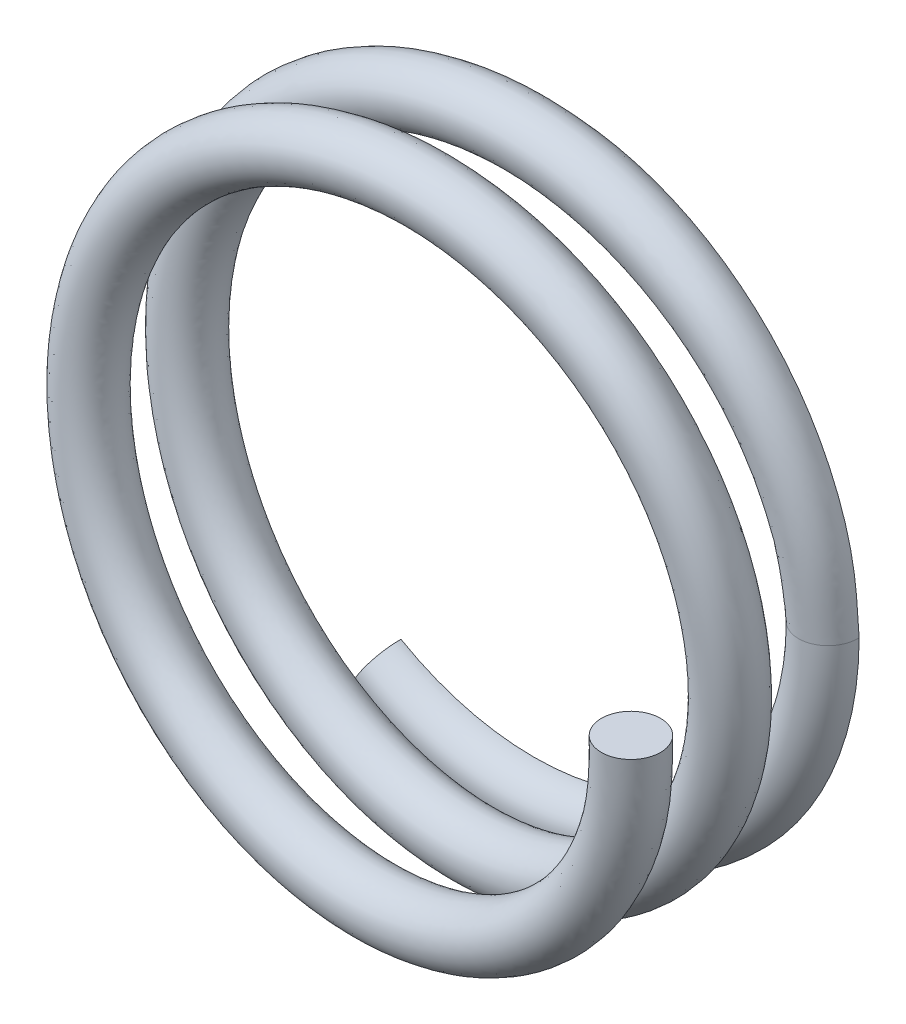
ISO-10303-21;
HEADER;
FILE_DESCRIPTION(('STEP AP214'),'2;1');
FILE_NAME('part.step','',(''),(''),'','','');
FILE_SCHEMA(('AUTOMOTIVE_DESIGN { 1 0 10303 214 1 1 1 1 }'));
ENDSEC;
DATA;
#1=APPLICATION_CONTEXT('core data for automotive mechanical design processes');
#2=APPLICATION_PROTOCOL_DEFINITION('international standard','automotive_design',2000,#1);
#3=PRODUCT_CONTEXT('',#1,'mechanical');
#4=PRODUCT('Part','Part','',(#3));
#5=PRODUCT_RELATED_PRODUCT_CATEGORY('part','',(#4));
#6=PRODUCT_DEFINITION_FORMATION('','',#4);
#7=PRODUCT_DEFINITION_CONTEXT('part definition',#1,'design');
#8=PRODUCT_DEFINITION('design','',#6,#7);
#9=PRODUCT_DEFINITION_SHAPE('','',#8);
#10=(LENGTH_UNIT() NAMED_UNIT(*) SI_UNIT(.MILLI.,.METRE.));
#11=(NAMED_UNIT(*) PLANE_ANGLE_UNIT() SI_UNIT($,.RADIAN.));
#12=(NAMED_UNIT(*) SI_UNIT($,.STERADIAN.) SOLID_ANGLE_UNIT());
#13=UNCERTAINTY_MEASURE_WITH_UNIT(LENGTH_MEASURE(1.E-05),#10,'distance_accuracy_value','');
#14=(GEOMETRIC_REPRESENTATION_CONTEXT(3) GLOBAL_UNCERTAINTY_ASSIGNED_CONTEXT((#13)) GLOBAL_UNIT_ASSIGNED_CONTEXT((#10,
#11,#12)) REPRESENTATION_CONTEXT('',''));
#15=CARTESIAN_POINT('',(0.,0.,0.));
#16=DIRECTION('',(0.,0.,1.));
#17=DIRECTION('',(1.,0.,0.));
#18=AXIS2_PLACEMENT_3D('',#15,#16,#17);
#19=CARTESIAN_POINT('',(15.,0.,1.5));
#20=CARTESIAN_POINT('',(14.9434686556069,0.980039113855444,1.55199637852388));
#21=CARTESIAN_POINT('',(14.8302225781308,2.94329660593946,1.65615781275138));
#22=CARTESIAN_POINT('',(13.9418455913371,5.77650274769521,1.81245356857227));
#23=CARTESIAN_POINT('',(12.5535226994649,8.38759891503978,1.96879275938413));
#24=CARTESIAN_POINT('',(10.4671696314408,10.9271623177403,2.14223062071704));
#25=CARTESIAN_POINT('',(7.58613571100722,13.1398555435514,2.33334011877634));
#26=CARTESIAN_POINT('',(3.92662071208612,14.6543917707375,2.54166504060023));
#27=CARTESIAN_POINT('',(4.11401899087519E-05,15.1715918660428,2.75000784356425));
#28=CARTESIAN_POINT('',(-3.92693257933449,14.6556022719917,2.95833111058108));
#29=CARTESIAN_POINT('',(-7.58586251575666,13.1389788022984,3.1666585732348));
#30=CARTESIAN_POINT('',(-10.7277085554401,10.7277374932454,3.37500627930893));
#31=CARTESIAN_POINT('',(-13.1395863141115,7.58619905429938,3.58333901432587));
#32=CARTESIAN_POINT('',(-14.6551693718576,3.92680798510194,3.79165669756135));
#33=CARTESIAN_POINT('',(-15.1712462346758,-3.12971002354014E-05,3.99999979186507));
#34=CARTESIAN_POINT('',(-14.6548300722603,-3.92669076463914,4.20834340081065));
#35=CARTESIAN_POINT('',(-13.1398206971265,-7.58627068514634,4.41666146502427));
#36=CARTESIAN_POINT('',(-10.7278130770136,-10.7278977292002,4.62499295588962));
#37=CARTESIAN_POINT('',(-7.58571450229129,-13.1387744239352,4.83334182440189));
#38=CARTESIAN_POINT('',(-3.92696085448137,-14.6554610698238,5.04166963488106));
#39=CARTESIAN_POINT('',(4.36291658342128E-05,-15.1719571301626,5.24998976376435));
#40=CARTESIAN_POINT('',(3.92661725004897,-14.6542791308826,5.45833563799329));
#41=CARTESIAN_POINT('',(7.5859316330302,-13.1393329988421,5.66667583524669));
#42=CARTESIAN_POINT('',(10.7285480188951,-10.7285399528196,5.87499262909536));
#43=CARTESIAN_POINT('',(13.1388208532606,-7.58563797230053,6.08332834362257));
#44=CARTESIAN_POINT('',(14.6545092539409,-3.92671133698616,6.29167635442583));
#45=CARTESIAN_POINT('',(15.1725636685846,-3.08605043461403E-05,6.50000018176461));
#46=CARTESIAN_POINT('',(14.6547973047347,3.92679649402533,6.70832353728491));
#47=CARTESIAN_POINT('',(13.1386860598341,7.58562008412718,6.91667133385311));
#48=CARTESIAN_POINT('',(10.7283643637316,10.7282883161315,7.12500762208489));
#49=CARTESIAN_POINT('',(7.58613817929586,13.1396144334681,7.33332434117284));
#50=CARTESIAN_POINT('',(3.92657585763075,14.6543562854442,7.54166400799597));
#51=CARTESIAN_POINT('',(5.35997314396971E-05,15.1716155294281,7.75001022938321));
#52=CARTESIAN_POINT('',(-3.92693805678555,14.6556080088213,7.95833071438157));
#53=CARTESIAN_POINT('',(-7.58585858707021,13.1389737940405,8.16665797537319));
#54=CARTESIAN_POINT('',(-10.7277098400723,10.7277381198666,8.37500677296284));
#55=CARTESIAN_POINT('',(-13.1395867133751,7.58619950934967,8.5833388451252));
#56=CARTESIAN_POINT('',(-14.6551692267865,3.92680794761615,8.79165668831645));
#57=CARTESIAN_POINT('',(-15.1712461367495,-3.14499375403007E-05,8.9999998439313));
#58=CARTESIAN_POINT('',(-14.654829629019,-3.92669054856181,9.20834339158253));
#59=CARTESIAN_POINT('',(-13.1398232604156,-7.58627176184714,9.41666129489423));
#60=CARTESIAN_POINT('',(-10.7278077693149,-10.7278945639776,9.62499345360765));
#61=CARTESIAN_POINT('',(-7.58571958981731,-13.1387763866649,9.83334122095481));
#62=CARTESIAN_POINT('',(-3.92696098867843,-14.655487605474,10.041669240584));
#63=CARTESIAN_POINT('',(2.9082075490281E-05,-15.171864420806,10.2499921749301));
#64=CARTESIAN_POINT('',(3.92668405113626,-14.6543878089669,10.4583345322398));
#65=CARTESIAN_POINT('',(7.58592254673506,-13.1395893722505,10.6666601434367));
#66=CARTESIAN_POINT('',(10.4672636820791,-10.9272676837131,10.8577695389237));
#67=CARTESIAN_POINT('',(12.553480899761,-8.38754549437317,11.0312069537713));
#68=CARTESIAN_POINT('',(13.9422248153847,-5.77671048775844,11.187546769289));
#69=CARTESIAN_POINT('',(14.8299103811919,-2.94320033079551,11.3438418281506));
#70=CARTESIAN_POINT('',(14.9432613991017,-0.980005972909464,11.4480035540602));
#71=CARTESIAN_POINT('',(14.9998450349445,4.25082742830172E-10,11.4999999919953));
#72=CARTESIAN_POINT('',(18.,0.,1.5));
#73=CARTESIAN_POINT('',(17.9323063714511,1.17617130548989,1.55193830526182));
#74=CARTESIAN_POINT('',(17.7966995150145,3.53232943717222,1.6559834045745));
#75=CARTESIAN_POINT('',(16.7304312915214,6.93069596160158,1.81304095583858));
#76=CARTESIAN_POINT('',(15.0648037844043,10.0648097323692,1.96888233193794));
#77=CARTESIAN_POINT('',(12.5582750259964,13.1148525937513,2.14252497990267));
#78=CARTESIAN_POINT('',(9.10608570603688,15.7659272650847,2.33316062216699));
#79=CARTESIAN_POINT('',(4.71216641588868,17.5858635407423,2.54183736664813));
#80=CARTESIAN_POINT('',(-0.00209417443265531,18.2059563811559,2.75042629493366));
#81=CARTESIAN_POINT('',(-4.71136257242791,17.5866699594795,2.958385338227));
#82=CARTESIAN_POINT('',(-9.10182717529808,15.7677965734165,3.16657352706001));
#83=CARTESIAN_POINT('',(-12.8743834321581,12.8727598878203,3.37533635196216));
#84=CARTESIAN_POINT('',(-15.7680538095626,9.10199791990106,3.58373251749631));
#85=CARTESIAN_POINT('',(-17.5855251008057,4.71436549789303,3.7914596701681));
#86=CARTESIAN_POINT('',(-18.2060659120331,-2.21536066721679E-05,4.00015466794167));
#87=CARTESIAN_POINT('',(-17.5851902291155,-4.71423300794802,4.20884973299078));
#88=CARTESIAN_POINT('',(-15.7682950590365,-9.10205608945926,4.41658110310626));
#89=CARTESIAN_POINT('',(-12.8745053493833,-12.8729042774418,4.62496853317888));
#90=CARTESIAN_POINT('',(-9.10167577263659,-15.7675961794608,4.83373398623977));
#91=CARTESIAN_POINT('',(-4.71143842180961,-17.5864986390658,5.04195919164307));
#92=CARTESIAN_POINT('',(-0.0021430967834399,-18.2063741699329,5.24981036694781));
#93=CARTESIAN_POINT('',(4.7124657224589,-17.5855720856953,5.45855207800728));
#94=CARTESIAN_POINT('',(9.1049848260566,-15.7659968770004,5.66717218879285));
#95=CARTESIAN_POINT('',(12.8726878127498,-12.8754697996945,5.8748441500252));
#96=CARTESIAN_POINT('',(15.7665939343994,-9.10371710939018,6.08336225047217));
#97=CARTESIAN_POINT('',(17.5861149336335,-4.71026018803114,6.29212393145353));
#98=CARTESIAN_POINT('',(18.2067610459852,-3.84891972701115E-05,6.50015514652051));
#99=CARTESIAN_POINT('',(17.5864072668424,4.71032890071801,6.70818589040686));
#100=CARTESIAN_POINT('',(15.7664681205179,9.10368379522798,6.91694735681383));
#101=CARTESIAN_POINT('',(12.8725152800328,12.875207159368,7.12546603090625));
#102=CARTESIAN_POINT('',(9.1052051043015,15.7662702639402,7.33313791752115));
#103=CARTESIAN_POINT('',(4.71244168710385,17.5856445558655,7.54175749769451));
#104=CARTESIAN_POINT('',(-0.00211652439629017,18.2060326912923,7.75049955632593));
#105=CARTESIAN_POINT('',(-4.71140083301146,17.5866495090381,7.95835108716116));
#106=CARTESIAN_POINT('',(-9.10180477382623,15.7678041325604,8.16657574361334));
#107=CARTESIAN_POINT('',(-12.8743897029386,12.872757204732,8.37534112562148));
#108=CARTESIAN_POINT('',(-15.7680534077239,9.10199831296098,8.58372913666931));
#109=CARTESIAN_POINT('',(-17.5855250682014,4.71436584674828,8.791460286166));
#110=CARTESIAN_POINT('',(-18.2060658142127,-2.25735037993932E-05,9.00015489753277));
#111=CARTESIAN_POINT('',(-17.5851896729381,-4.71423240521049,9.20885034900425));
#112=CARTESIAN_POINT('',(-15.7682984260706,-9.10205722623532,9.41657772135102));
#113=CARTESIAN_POINT('',(-12.8744950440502,-12.8729044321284,9.62497331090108));
#114=CARTESIAN_POINT('',(-9.10169935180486,-15.7675855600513,9.83373619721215));
#115=CARTESIAN_POINT('',(-4.71140576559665,-17.5865513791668,10.0419249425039));
#116=CARTESIAN_POINT('',(-0.00212275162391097,-18.2062287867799,10.2498836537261));
#117=CARTESIAN_POINT('',(4.71221213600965,-17.5858643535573,10.4584721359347));
#118=CARTESIAN_POINT('',(9.10585910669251,-15.7656689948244,10.6671495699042));
#119=CARTESIAN_POINT('',(12.5583574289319,-13.114968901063,10.8577851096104));
#120=CARTESIAN_POINT('',(15.0647522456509,-10.0647709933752,11.0314273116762));
#121=CARTESIAN_POINT('',(16.7308047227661,-6.9309177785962,11.1872693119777));
#122=CARTESIAN_POINT('',(17.7963837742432,-3.53225069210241,11.3443261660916));
#123=CARTESIAN_POINT('',(17.9320979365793,-1.17615475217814,11.4483715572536));
#124=CARTESIAN_POINT('',(17.99984501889,-1.64418778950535E-05,11.5003099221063));
#125=CARTESIAN_POINT('',(18.,0.,-1.5));
#126=CARTESIAN_POINT('',(17.9322539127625,1.17614724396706,-1.44806169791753));
#127=CARTESIAN_POINT('',(17.7965419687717,3.53225717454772,-1.34401660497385));
#128=CARTESIAN_POINT('',(16.7309520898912,6.93096946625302,-1.18695900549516));
#129=CARTESIAN_POINT('',(15.0648944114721,10.0648383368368,-1.03111766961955));
#130=CARTESIAN_POINT('',(12.5584754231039,13.1150736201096,-0.857475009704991));
#131=CARTESIAN_POINT('',(9.10594614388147,15.7657987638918,-0.666839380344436));
#132=CARTESIAN_POINT('',(4.71227811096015,17.5860086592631,-0.458162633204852));
#133=CARTESIAN_POINT('',(-0.00210690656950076,18.2063865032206,-0.249573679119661));
#134=CARTESIAN_POINT('',(-4.71143793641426,17.5867047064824,-0.0416146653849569));
#135=CARTESIAN_POINT('',(-9.10175901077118,15.7677312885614,0.166573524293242));
#136=CARTESIAN_POINT('',(-12.8745903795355,12.873031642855,0.375336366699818));
#137=CARTESIAN_POINT('',(-15.7684298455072,9.10214392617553,0.583732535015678));
#138=CARTESIAN_POINT('',(-17.5853365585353,4.71428665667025,0.791459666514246));
#139=CARTESIAN_POINT('',(-18.2062225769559,4.75475799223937E-05,1.0001546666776));
#140=CARTESIAN_POINT('',(-17.5856809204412,-4.71439295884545,1.20884976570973));
#141=CARTESIAN_POINT('',(-15.7681935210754,-9.10206822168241,1.41658109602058));
#142=CARTESIAN_POINT('',(-12.874516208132,-12.8728515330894,1.62496852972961));
#143=CARTESIAN_POINT('',(-9.1019016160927,-15.7679300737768,1.83373400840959));
#144=CARTESIAN_POINT('',(-4.71144975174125,-17.5867989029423,2.04195919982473));
#145=CARTESIAN_POINT('',(-0.00213308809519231,-18.206188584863,2.24981036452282));
#146=CARTESIAN_POINT('',(4.71245845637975,-17.5858025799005,2.45855208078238));
#147=CARTESIAN_POINT('',(9.10527327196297,-15.7664127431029,2.66717221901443));
#148=CARTESIAN_POINT('',(12.8726180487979,-12.8753251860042,2.87484414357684));
#149=CARTESIAN_POINT('',(15.7665915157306,-9.10378273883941,3.08336224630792));
#150=CARTESIAN_POINT('',(17.5865546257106,-4.71038774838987,3.29212395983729));
#151=CARTESIAN_POINT('',(18.2069177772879,3.01427640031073E-05,3.50015514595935));
#152=CARTESIAN_POINT('',(17.5862704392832,4.71028228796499,3.70818588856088));
#153=CARTESIAN_POINT('',(15.7667420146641,9.10377499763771,3.9169473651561));
#154=CARTESIAN_POINT('',(12.8728065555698,12.875573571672,4.12546605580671));
#155=CARTESIAN_POINT('',(9.10507359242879,15.7661257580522,4.33313791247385));
#156=CARTESIAN_POINT('',(4.71253014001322,17.585716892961,4.54175749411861));
#157=CARTESIAN_POINT('',(-0.00212675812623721,18.2065317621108,4.75049958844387));
#158=CARTESIAN_POINT('',(-4.71147054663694,17.586652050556,4.9583510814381));
#159=CARTESIAN_POINT('',(-9.10173554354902,15.7677418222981,5.16657574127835));
#160=CARTESIAN_POINT('',(-12.8746006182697,12.8730315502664,5.37534114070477));
#161=CARTESIAN_POINT('',(-15.7684264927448,9.10214277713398,5.58372915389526));
#162=CARTESIAN_POINT('',(-17.5853371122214,4.71428725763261,5.7914602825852));
#163=CARTESIAN_POINT('',(-18.2062226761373,4.71276689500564E-05,6.00015489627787));
#164=CARTESIAN_POINT('',(-17.5856809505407,-4.71439260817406,6.20885038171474));
#165=CARTESIAN_POINT('',(-15.7681939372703,-9.10206781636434,6.41657771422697));
#166=CARTESIAN_POINT('',(-12.8745098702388,-12.8728542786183,6.62497330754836));
#167=CARTESIAN_POINT('',(-9.10192413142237,-15.7679224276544,6.83373621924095));
#168=CARTESIAN_POINT('',(-4.71141144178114,-17.5868194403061,7.04192494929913));
#169=CARTESIAN_POINT('',(-0.00211024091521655,-18.2061121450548,7.249883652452));
#170=CARTESIAN_POINT('',(4.71218159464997,-17.5860220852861,7.45847213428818));
#171=CARTESIAN_POINT('',(9.10615569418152,-15.7660687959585,7.66714960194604));
#172=CARTESIAN_POINT('',(12.5583730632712,-13.1149738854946,7.85778510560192));
#173=CARTESIAN_POINT('',(15.0649210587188,-10.0649156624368,8.0314273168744));
#174=CARTESIAN_POINT('',(16.7305720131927,-6.93076351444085,8.18726930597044));
#175=CARTESIAN_POINT('',(17.7968477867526,-3.53238380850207,8.34432619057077));
#176=CARTESIAN_POINT('',(17.9324591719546,-1.17619907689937,8.44837157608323));
#177=CARTESIAN_POINT('',(18.000154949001,-1.64427272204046E-05,8.50030993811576));
#178=CARTESIAN_POINT('',(15.,0.,-1.5));
#179=CARTESIAN_POINT('',(14.9434161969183,0.980015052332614,-1.44800362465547));
#180=CARTESIAN_POINT('',(14.830065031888,2.94322434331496,-1.34384219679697));
#181=CARTESIAN_POINT('',(13.9423663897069,5.77677625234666,-1.18754639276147));
#182=CARTESIAN_POINT('',(12.5536133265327,8.38762751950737,-1.03120724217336));
#183=CARTESIAN_POINT('',(10.4673700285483,10.9273833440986,-0.857769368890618));
#184=CARTESIAN_POINT('',(7.58599614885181,13.1397270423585,-0.666659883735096));
#185=CARTESIAN_POINT('',(3.92673240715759,14.6545368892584,-0.458334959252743));
#186=CARTESIAN_POINT('',(2.84080530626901E-05,15.1720219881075,-0.249992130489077));
#187=CARTESIAN_POINT('',(-3.92700794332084,14.6556370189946,-0.0416688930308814));
#188=CARTESIAN_POINT('',(-7.58579435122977,13.1389135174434,0.166658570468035));
#189=CARTESIAN_POINT('',(-10.7279155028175,10.7280092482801,0.375006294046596));
#190=CARTESIAN_POINT('',(-13.1399623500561,7.58634506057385,0.58333903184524));
#191=CARTESIAN_POINT('',(-14.6549808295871,3.92672914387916,0.791656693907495));
#192=CARTESIAN_POINT('',(-15.1714028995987,3.8404086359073E-05,0.999999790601));
#193=CARTESIAN_POINT('',(-14.655320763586,-3.92685071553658,1.2083434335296));
#194=CARTESIAN_POINT('',(-13.1397191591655,-7.58628281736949,1.41666145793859));
#195=CARTESIAN_POINT('',(-10.7278239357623,-10.7278449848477,1.62499295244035));
#196=CARTESIAN_POINT('',(-7.58594034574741,-13.1391083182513,1.83334184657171));
#197=CARTESIAN_POINT('',(-3.926972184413,-14.6557613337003,2.04166964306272));
#198=CARTESIAN_POINT('',(5.36378540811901E-05,-15.1717715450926,2.24998976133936));
#199=CARTESIAN_POINT('',(3.92660998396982,-14.6545096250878,2.45833564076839));
#200=CARTESIAN_POINT('',(7.58622007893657,-13.1397488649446,2.66667586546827));
#201=CARTESIAN_POINT('',(10.7284782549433,-10.7283953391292,2.87499262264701));
#202=CARTESIAN_POINT('',(13.1388184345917,-7.58570360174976,3.08332833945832));
#203=CARTESIAN_POINT('',(14.654948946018,-3.9268388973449,3.2916763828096));
#204=CARTESIAN_POINT('',(15.1727203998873,3.77714569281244E-05,3.50000018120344));
#205=CARTESIAN_POINT('',(14.6546604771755,3.92674988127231,3.70832353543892));
#206=CARTESIAN_POINT('',(13.1389599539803,7.58571128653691,3.91667134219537));
#207=CARTESIAN_POINT('',(10.7286556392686,10.7286547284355,4.12500764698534));
#208=CARTESIAN_POINT('',(7.58600666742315,13.13946992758,4.33332433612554));
#209=CARTESIAN_POINT('',(3.92666431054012,14.6544286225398,4.54166400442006));
#210=CARTESIAN_POINT('',(4.33660014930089E-05,15.1721146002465,4.75001026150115));
#211=CARTESIAN_POINT('',(-3.92700777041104,14.6556105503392,4.95833070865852));
#212=CARTESIAN_POINT('',(-7.585789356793,13.1389114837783,5.1666579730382));
#213=CARTESIAN_POINT('',(-10.7279207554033,10.728012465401,5.37500678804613));
#214=CARTESIAN_POINT('',(-13.1399597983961,7.58634397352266,5.58333886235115));
#215=CARTESIAN_POINT('',(-14.6549812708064,3.92672935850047,5.79165668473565));
#216=CARTESIAN_POINT('',(-15.1714029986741,3.82512352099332E-05,5.9999998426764));
#217=CARTESIAN_POINT('',(-14.6553209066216,-3.92685075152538,6.20834342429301));
#218=CARTESIAN_POINT('',(-13.1397187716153,-7.58628235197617,6.41666128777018));
#219=CARTESIAN_POINT('',(-10.7278225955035,-10.7278444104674,6.62499345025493));
#220=CARTESIAN_POINT('',(-7.58594436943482,-13.139113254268,6.83334124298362));
#221=CARTESIAN_POINT('',(-3.92696666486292,-14.6557556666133,7.04166924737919));
#222=CARTESIAN_POINT('',(4.15927841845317E-05,-15.171747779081,7.24999217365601));
#223=CARTESIAN_POINT('',(3.92665350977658,-14.6545455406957,7.45833453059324));
#224=CARTESIAN_POINT('',(7.58621913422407,-13.1399891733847,7.6666601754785));
#225=CARTESIAN_POINT('',(10.4672793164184,-10.9272726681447,7.85776953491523));
#226=CARTESIAN_POINT('',(12.5536497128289,-8.38769016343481,8.03120695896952));
#227=CARTESIAN_POINT('',(13.9419921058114,-5.77655622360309,8.1875467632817));
#228=CARTESIAN_POINT('',(14.8303743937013,-2.94333344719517,8.34384185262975));
#229=CARTESIAN_POINT('',(14.943622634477,-0.980050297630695,8.44800357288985));
#230=CARTESIAN_POINT('',(15.0001549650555,-4.24242608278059E-10,8.50000000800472));
#231=CARTESIAN_POINT('',(12.,0.,-1.5));
#232=CARTESIAN_POINT('',(11.9545784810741,0.783882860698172,-1.44794555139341));
#233=CARTESIAN_POINT('',(11.8635880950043,2.35419151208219,-1.34366778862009));
#234=CARTESIAN_POINT('',(11.1537806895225,4.6225830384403,-1.18813378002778));
#235=CARTESIAN_POINT('',(10.0423322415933,6.71041670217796,-1.03129681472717));
#236=CARTESIAN_POINT('',(8.37626463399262,8.73969306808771,-0.858063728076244));
#237=CARTESIAN_POINT('',(6.06604615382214,10.5136553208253,-0.666480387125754));
#238=CARTESIAN_POINT('',(3.14118670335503,11.7230651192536,-0.458507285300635));
#239=CARTESIAN_POINT('',(0.00216372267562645,12.1376574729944,-0.250410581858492));
#240=CARTESIAN_POINT('',(-3.14257795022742,11.7245693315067,-0.041723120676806));
#241=CARTESIAN_POINT('',(-6.06982969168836,10.5100957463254,0.166743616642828));
#242=CARTESIAN_POINT('',(-8.5812406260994,8.58298685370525,0.374676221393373));
#243=CARTESIAN_POINT('',(-10.5114948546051,6.07054619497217,0.582945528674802));
#244=CARTESIAN_POINT('',(-11.724625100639,3.13917163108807,0.791853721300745));
#245=CARTESIAN_POINT('',(-12.1365832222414,2.92605927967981E-05,0.999844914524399));
#246=CARTESIAN_POINT('',(-11.7249606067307,-3.13930847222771,1.20783710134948));
#247=CARTESIAN_POINT('',(-10.5112447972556,-6.07049741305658,1.4167418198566));
#248=CARTESIAN_POINT('',(-8.58113166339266,-8.58283843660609,1.62501737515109));
#249=CARTESIAN_POINT('',(-6.06997907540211,-10.5102865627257,1.83294968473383));
#250=CARTESIAN_POINT('',(-3.14249461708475,-11.7247237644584,2.04138008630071));
#251=CARTESIAN_POINT('',(0.00224036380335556,-12.1373545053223,2.25016915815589));
#252=CARTESIAN_POINT('',(3.14076151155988,-11.7232166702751,2.45811920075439));
#253=CARTESIAN_POINT('',(6.06716688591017,-10.5130849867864,2.6661795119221));
#254=CARTESIAN_POINT('',(8.58433846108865,-8.58146549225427,2.87514110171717));
#255=CARTESIAN_POINT('',(10.5110453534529,-6.06762446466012,3.08329443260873));
#256=CARTESIAN_POINT('',(11.7233432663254,-3.14329004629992,3.2912288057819));
#257=CARTESIAN_POINT('',(12.1385230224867,4.54001498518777E-05,3.49984521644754));
#258=CARTESIAN_POINT('',(11.7230505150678,3.14321747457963,3.70846118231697));
#259=CARTESIAN_POINT('',(10.5111778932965,6.06764757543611,3.91639531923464));
#260=CARTESIAN_POINT('',(8.58450472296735,8.58173588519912,4.12454923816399));
#261=CARTESIAN_POINT('',(6.06693974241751,10.5128140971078,4.33351075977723));
#262=CARTESIAN_POINT('',(3.14079848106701,11.7231403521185,4.54157051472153));
#263=CARTESIAN_POINT('',(0.00221349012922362,12.1376974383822,4.74952093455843));
#264=CARTESIAN_POINT('',(-3.14254499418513,11.7245690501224,4.95831033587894));
#265=CARTESIAN_POINT('',(-6.06984317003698,10.5100811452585,5.16674020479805));
#266=CARTESIAN_POINT('',(-8.58124089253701,8.58299338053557,5.37467243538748));
#267=CARTESIAN_POINT('',(-10.5114931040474,6.07054516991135,5.58294857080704));
#268=CARTESIAN_POINT('',(-11.7246254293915,3.13917145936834,5.79185308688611));
#269=CARTESIAN_POINT('',(-12.136583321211,2.93748014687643E-05,5.99984478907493));
#270=CARTESIAN_POINT('',(-11.7249608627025,-3.1393088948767,6.20783646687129));
#271=CARTESIAN_POINT('',(-10.5112436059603,-6.07049688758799,6.41674486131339));
#272=CARTESIAN_POINT('',(-8.58113532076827,-8.58283454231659,6.6250135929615));
#273=CARTESIAN_POINT('',(-6.06996460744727,-10.5103040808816,6.83294626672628));
#274=CARTESIAN_POINT('',(-3.14252188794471,-11.7246918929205,7.04141354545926));
#275=CARTESIAN_POINT('',(0.0021934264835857,-12.1373834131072,7.25010069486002));
#276=CARTESIAN_POINT('',(3.14112542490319,-11.7230689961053,7.45819692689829));
#277=CARTESIAN_POINT('',(6.06628257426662,-10.5139095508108,7.66617074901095));
#278=CARTESIAN_POINT('',(8.37618556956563,-8.7395714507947,7.85775396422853));
#279=CARTESIAN_POINT('',(10.042378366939,-6.71046466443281,8.03098660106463));
#280=CARTESIAN_POINT('',(11.15341219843,-4.62234893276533,8.18782422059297));
#281=CARTESIAN_POINT('',(11.8639010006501,-2.35428308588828,8.34335751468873));
#282=CARTESIAN_POINT('',(11.9547860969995,-0.783901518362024,8.44763556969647));
#283=CARTESIAN_POINT('',(12.00015498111,1.6441878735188E-05,8.49969007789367));
#284=CARTESIAN_POINT('',(12.,0.,1.5));
#285=CARTESIAN_POINT('',(11.9546309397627,0.783906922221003,1.55205445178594));
#286=CARTESIAN_POINT('',(11.8637456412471,2.35426377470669,1.65633222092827));
#287=CARTESIAN_POINT('',(11.1532598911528,4.62230953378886,1.81186618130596));
#288=CARTESIAN_POINT('',(10.0422416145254,6.71038809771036,1.96870318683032));
#289=CARTESIAN_POINT('',(8.37606423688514,8.73947204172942,2.14193626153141));
#290=CARTESIAN_POINT('',(6.06618571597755,10.5137838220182,2.33351961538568));
#291=CARTESIAN_POINT('',(3.14107500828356,11.7229200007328,2.54149271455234));
#292=CARTESIAN_POINT('',(0.00217645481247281,12.1372273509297,2.74958939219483));
#293=CARTESIAN_POINT('',(-3.14250258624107,11.7245345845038,2.95827688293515));
#294=CARTESIAN_POINT('',(-6.06989785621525,10.5101610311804,3.16674361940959));
#295=CARTESIAN_POINT('',(-8.581033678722,8.58271509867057,3.37467620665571));
#296=CARTESIAN_POINT('',(-10.5111188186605,6.07040018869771,3.58294551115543));
#297=CARTESIAN_POINT('',(-11.7248136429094,3.13925047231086,3.7918537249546));
#298=CARTESIAN_POINT('',(-12.1364265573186,-4.04405937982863E-05,3.99984491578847));
#299=CARTESIAN_POINT('',(-11.7244699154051,-3.13914852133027,4.20783706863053));
#300=CARTESIAN_POINT('',(-10.5113463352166,-6.07048528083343,4.41674182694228));
#301=CARTESIAN_POINT('',(-8.58112080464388,-8.58289118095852,4.62501737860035));
#302=CARTESIAN_POINT('',(-6.069753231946,-10.5099526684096,4.83294966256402));
#303=CARTESIAN_POINT('',(-3.14248328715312,-11.7244235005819,5.04138007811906));
#304=CARTESIAN_POINT('',(0.00223035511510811,-12.1375400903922,5.25016916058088));
#305=CARTESIAN_POINT('',(3.14076877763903,-11.7229861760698,5.4581191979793));
#306=CARTESIAN_POINT('',(6.0668784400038,-10.5126691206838,5.66617948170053));
#307=CARTESIAN_POINT('',(8.58440822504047,-8.5816101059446,5.87514110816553));
#308=CARTESIAN_POINT('',(10.5110477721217,-6.06755883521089,6.08329443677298));
#309=CARTESIAN_POINT('',(11.7229035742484,-3.14316248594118,6.29122877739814));
#310=CARTESIAN_POINT('',(12.138366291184,-2.32318114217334E-05,6.4998452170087));
#311=CARTESIAN_POINT('',(11.723187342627,3.14326408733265,6.70846118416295));
#312=CARTESIAN_POINT('',(10.5109039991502,6.06755637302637,6.91639531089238));
#313=CARTESIAN_POINT('',(8.58421344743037,8.58136947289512,7.12454921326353));
#314=CARTESIAN_POINT('',(6.06707125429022,10.5129586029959,7.33351076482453));
#315=CARTESIAN_POINT('',(3.14071002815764,11.723068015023,7.54157051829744));
#316=CARTESIAN_POINT('',(0.00222372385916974,12.1371983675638,7.74952090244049));
#317=CARTESIAN_POINT('',(-3.14247528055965,11.7245665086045,7.95831034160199));
#318=CARTESIAN_POINT('',(-6.0699124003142,10.5101434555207,8.16674020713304));
#319=CARTESIAN_POINT('',(-8.58102997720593,8.58271903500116,8.3746724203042));
#320=CARTESIAN_POINT('',(-10.5111200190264,6.07040070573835,8.58294855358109));
#321=CARTESIAN_POINT('',(-11.7248133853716,3.13925004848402,8.79185309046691));
#322=CARTESIAN_POINT('',(-12.1364264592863,-4.0326371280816E-05,8.99984479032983));
#323=CARTESIAN_POINT('',(-11.7244695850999,-3.13914869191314,9.2078364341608));
#324=CARTESIAN_POINT('',(-10.5113480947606,-6.07048629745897,9.41674486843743));
#325=CARTESIAN_POINT('',(-8.58112049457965,-8.58288469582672,9.62501359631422));
#326=CARTESIAN_POINT('',(-6.06973982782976,-10.5099672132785,9.83294624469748));
#327=CARTESIAN_POINT('',(-3.14251621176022,-11.7244238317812,10.0414135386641));
#328=CARTESIAN_POINT('',(0.00218091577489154,-12.1375000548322,10.2501006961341));
#329=CARTESIAN_POINT('',(3.14115596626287,-11.7229112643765,10.4581969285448));
#330=CARTESIAN_POINT('',(6.06598598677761,-10.5135097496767,10.6661707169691));
#331=CARTESIAN_POINT('',(8.37616993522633,-8.7395664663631,10.857753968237));
#332=CARTESIAN_POINT('',(10.0422095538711,-6.71031999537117,11.0309865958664));
#333=CARTESIAN_POINT('',(11.1536449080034,-4.62250319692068,11.1878242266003));
#334=CARTESIAN_POINT('',(11.8634369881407,-2.35414996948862,11.3433574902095));
#335=CARTESIAN_POINT('',(11.9544248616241,-0.783857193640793,11.4476355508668));
#336=CARTESIAN_POINT('',(11.999845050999,1.64427280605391E-05,11.4996900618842));
#337=CARTESIAN_POINT('',(15.,0.,1.5));
#338=CARTESIAN_POINT('',(14.9434686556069,0.980039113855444,1.55199637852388));
#339=CARTESIAN_POINT('',(14.8302225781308,2.94329660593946,1.65615781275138));
#340=CARTESIAN_POINT('',(13.9418455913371,5.77650274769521,1.81245356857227));
#341=CARTESIAN_POINT('',(12.5535226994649,8.38759891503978,1.96879275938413));
#342=CARTESIAN_POINT('',(10.4671696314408,10.9271623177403,2.14223062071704));
#343=CARTESIAN_POINT('',(7.58613571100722,13.1398555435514,2.33334011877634));
#344=CARTESIAN_POINT('',(3.92662071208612,14.6543917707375,2.54166504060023));
#345=CARTESIAN_POINT('',(4.11401899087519E-05,15.1715918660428,2.75000784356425));
#346=CARTESIAN_POINT('',(-3.92693257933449,14.6556022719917,2.95833111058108));
#347=CARTESIAN_POINT('',(-7.58586251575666,13.1389788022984,3.1666585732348));
#348=CARTESIAN_POINT('',(-10.7277085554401,10.7277374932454,3.37500627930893));
#349=CARTESIAN_POINT('',(-13.1395863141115,7.58619905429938,3.58333901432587));
#350=CARTESIAN_POINT('',(-14.6551693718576,3.92680798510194,3.79165669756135));
#351=CARTESIAN_POINT('',(-15.1712462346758,-3.12971002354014E-05,3.99999979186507));
#352=CARTESIAN_POINT('',(-14.6548300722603,-3.92669076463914,4.20834340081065));
#353=CARTESIAN_POINT('',(-13.1398206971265,-7.58627068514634,4.41666146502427));
#354=CARTESIAN_POINT('',(-10.7278130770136,-10.7278977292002,4.62499295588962));
#355=CARTESIAN_POINT('',(-7.58571450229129,-13.1387744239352,4.83334182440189));
#356=CARTESIAN_POINT('',(-3.92696085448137,-14.6554610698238,5.04166963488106));
#357=CARTESIAN_POINT('',(4.36291658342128E-05,-15.1719571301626,5.24998976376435));
#358=CARTESIAN_POINT('',(3.92661725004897,-14.6542791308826,5.45833563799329));
#359=CARTESIAN_POINT('',(7.5859316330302,-13.1393329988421,5.66667583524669));
#360=CARTESIAN_POINT('',(10.7285480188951,-10.7285399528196,5.87499262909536));
#361=CARTESIAN_POINT('',(13.1388208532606,-7.58563797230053,6.08332834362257));
#362=CARTESIAN_POINT('',(14.6545092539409,-3.92671133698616,6.29167635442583));
#363=CARTESIAN_POINT('',(15.1725636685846,-3.08605043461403E-05,6.50000018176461));
#364=CARTESIAN_POINT('',(14.6547973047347,3.92679649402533,6.70832353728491));
#365=CARTESIAN_POINT('',(13.1386860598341,7.58562008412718,6.91667133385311));
#366=CARTESIAN_POINT('',(10.7283643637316,10.7282883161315,7.12500762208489));
#367=CARTESIAN_POINT('',(7.58613817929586,13.1396144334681,7.33332434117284));
#368=CARTESIAN_POINT('',(3.92657585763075,14.6543562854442,7.54166400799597));
#369=CARTESIAN_POINT('',(5.35997314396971E-05,15.1716155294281,7.75001022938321));
#370=CARTESIAN_POINT('',(-3.92693805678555,14.6556080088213,7.95833071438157));
#371=CARTESIAN_POINT('',(-7.58585858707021,13.1389737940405,8.16665797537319));
#372=CARTESIAN_POINT('',(-10.7277098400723,10.7277381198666,8.37500677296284));
#373=CARTESIAN_POINT('',(-13.1395867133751,7.58619950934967,8.5833388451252));
#374=CARTESIAN_POINT('',(-14.6551692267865,3.92680794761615,8.79165668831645));
#375=CARTESIAN_POINT('',(-15.1712461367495,-3.14499375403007E-05,8.9999998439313));
#376=CARTESIAN_POINT('',(-14.654829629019,-3.92669054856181,9.20834339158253));
#377=CARTESIAN_POINT('',(-13.1398232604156,-7.58627176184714,9.41666129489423));
#378=CARTESIAN_POINT('',(-10.7278077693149,-10.7278945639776,9.62499345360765));
#379=CARTESIAN_POINT('',(-7.58571958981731,-13.1387763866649,9.83334122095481));
#380=CARTESIAN_POINT('',(-3.92696098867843,-14.655487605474,10.041669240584));
#381=CARTESIAN_POINT('',(2.9082075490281E-05,-15.171864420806,10.2499921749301));
#382=CARTESIAN_POINT('',(3.92668405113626,-14.6543878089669,10.4583345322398));
#383=CARTESIAN_POINT('',(7.58592254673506,-13.1395893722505,10.6666601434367));
#384=CARTESIAN_POINT('',(10.4672636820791,-10.9272676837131,10.8577695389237));
#385=CARTESIAN_POINT('',(12.553480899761,-8.38754549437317,11.0312069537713));
#386=CARTESIAN_POINT('',(13.9422248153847,-5.77671048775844,11.187546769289));
#387=CARTESIAN_POINT('',(14.8299103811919,-2.94320033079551,11.3438418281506));
#388=CARTESIAN_POINT('',(14.9432613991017,-0.980005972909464,11.4480035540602));
#389=CARTESIAN_POINT('',(14.9998450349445,4.25082742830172E-10,11.4999999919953));
#390=(BOUNDED_SURFACE() B_SPLINE_SURFACE(3,3,((#19,#20,#21,#22,#23,#24,#25,#26,#27,#28,#29,#30,
#31,#32,#33,#34,#35,#36,#37,#38,#39,#40,#41,#42,#43,#44,#45,#46,#47,#48,#49,#50,#51,#52,#53,#54,
#55,#56,#57,#58,#59,#60,#61,#62,#63,#64,#65,#66,#67,#68,#69,#70,#71),(#72,#73,#74,#75,#76,#77,
#78,#79,#80,#81,#82,#83,#84,#85,#86,#87,#88,#89,#90,#91,#92,#93,#94,#95,#96,#97,#98,#99,#100,
#101,#102,#103,#104,#105,#106,#107,#108,#109,#110,#111,#112,#113,#114,#115,#116,#117,#118,#119,
#120,#121,#122,#123,#124),(#125,#126,#127,#128,#129,#130,#131,#132,#133,#134,#135,#136,#137,
#138,#139,#140,#141,#142,#143,#144,#145,#146,#147,#148,#149,#150,#151,#152,#153,#154,#155,#156,
#157,#158,#159,#160,#161,#162,#163,#164,#165,#166,#167,#168,#169,#170,#171,#172,#173,#174,#175,
#176,#177),(#178,#179,#180,#181,#182,#183,#184,#185,#186,#187,#188,#189,#190,#191,#192,#193,
#194,#195,#196,#197,#198,#199,#200,#201,#202,#203,#204,#205,#206,#207,#208,#209,#210,#211,#212,
#213,#214,#215,#216,#217,#218,#219,#220,#221,#222,#223,#224,#225,#226,#227,#228,#229,#230),
(#231,#232,#233,#234,#235,#236,#237,#238,#239,#240,#241,#242,#243,#244,#245,#246,#247,#248,#249,
#250,#251,#252,#253,#254,#255,#256,#257,#258,#259,#260,#261,#262,#263,#264,#265,#266,#267,#268,
#269,#270,#271,#272,#273,#274,#275,#276,#277,#278,#279,#280,#281,#282,#283),(#284,#285,#286,
#287,#288,#289,#290,#291,#292,#293,#294,#295,#296,#297,#298,#299,#300,#301,#302,#303,#304,#305,
#306,#307,#308,#309,#310,#311,#312,#313,#314,#315,#316,#317,#318,#319,#320,#321,#322,#323,#324,
#325,#326,#327,#328,#329,#330,#331,#332,#333,#334,#335,#336),(#337,#338,#339,#340,#341,#342,
#343,#344,#345,#346,#347,#348,#349,#350,#351,#352,#353,#354,#355,#356,#357,#358,#359,#360,#361,
#362,#363,#364,#365,#366,#367,#368,#369,#370,#371,#372,#373,#374,#375,#376,#377,#378,#379,#380,
#381,#382,#383,#384,#385,#386,#387,#388,#389)),.UNSPECIFIED.,.T.,.F.,
.F.) B_SPLINE_SURFACE_WITH_KNOTS((4,3,4),(4,1,1,1,1,1,1,1,1,1,1,1,1,1,1,1,1,1,1,1,1,1,1,1,1,1,1,
1,1,1,1,1,1,1,1,1,1,1,1,1,1,1,1,1,1,1,1,1,1,1,4),(0.,0.5,1.),(0.,0.0156173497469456,
0.0312853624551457,0.046931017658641,0.0625669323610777,0.0833983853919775,0.104228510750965,
0.125057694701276,0.145888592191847,0.166719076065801,0.187548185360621,0.208378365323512,
0.229209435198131,0.250038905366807,0.270868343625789,0.29169940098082,0.312529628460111,
0.333358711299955,0.354189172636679,0.375020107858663,0.395849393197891,0.416679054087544,
0.437510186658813,0.458340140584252,0.479169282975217,0.499999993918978,0.520830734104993,
0.541659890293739,0.562489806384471,0.583320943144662,0.604150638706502,0.624979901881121,
0.64581081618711,0.666641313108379,0.687470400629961,0.70830058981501,0.729131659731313,
0.749961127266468,0.770790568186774,0.791621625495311,0.812451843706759,0.833280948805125,
0.854111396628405,0.874942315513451,0.895771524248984,0.916601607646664,0.937433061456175,
0.953068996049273,0.968714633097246,0.984382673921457,1.),
.UNSPECIFIED.) GEOMETRIC_REPRESENTATION_ITEM() RATIONAL_B_SPLINE_SURFACE(((1.,1.,1.,1.,1.,1.,1.,
1.,1.,1.,1.,1.,1.,1.,1.,1.,1.,1.,1.,1.,1.,1.,1.,1.,1.,1.,1.,1.,1.,1.,1.,1.,1.,1.,1.,1.,1.,1.,1.,
1.,1.,1.,1.,1.,1.,1.,1.,1.,1.,1.,1.,1.,1.),(0.333333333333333,0.333333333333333,
0.333333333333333,0.333333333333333,0.333333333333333,0.333333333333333,0.333333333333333,
0.333333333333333,0.333333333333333,0.333333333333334,0.333333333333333,0.333333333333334,
0.333333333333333,0.333333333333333,0.333333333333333,0.333333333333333,0.333333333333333,
0.333333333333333,0.333333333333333,0.333333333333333,0.333333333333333,0.333333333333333,
0.333333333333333,0.333333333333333,0.333333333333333,0.333333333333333,0.333333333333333,
0.333333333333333,0.333333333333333,0.333333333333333,0.333333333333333,0.333333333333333,
0.333333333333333,0.333333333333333,0.333333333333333,0.333333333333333,0.333333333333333,
0.333333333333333,0.333333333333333,0.333333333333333,0.333333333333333,0.333333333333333,
0.333333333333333,0.333333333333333,0.333333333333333,0.333333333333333,0.333333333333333,
0.333333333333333,0.333333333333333,0.333333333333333,0.333333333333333,0.333333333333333,
0.333333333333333),(0.333333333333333,0.333333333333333,0.333333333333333,0.333333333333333,
0.333333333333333,0.333333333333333,0.333333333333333,0.333333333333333,0.333333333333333,
0.333333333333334,0.333333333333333,0.333333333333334,0.333333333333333,0.333333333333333,
0.333333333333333,0.333333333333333,0.333333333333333,0.333333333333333,0.333333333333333,
0.333333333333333,0.333333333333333,0.333333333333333,0.333333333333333,0.333333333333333,
0.333333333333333,0.333333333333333,0.333333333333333,0.333333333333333,0.333333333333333,
0.333333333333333,0.333333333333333,0.333333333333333,0.333333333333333,0.333333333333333,
0.333333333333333,0.333333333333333,0.333333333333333,0.333333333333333,0.333333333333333,
0.333333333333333,0.333333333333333,0.333333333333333,0.333333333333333,0.333333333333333,
0.333333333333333,0.333333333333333,0.333333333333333,0.333333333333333,0.333333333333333,
0.333333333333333,0.333333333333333,0.333333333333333,0.333333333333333),(1.,1.,1.,1.,1.,1.,1.,
1.,1.,1.,1.,1.,1.,1.,1.,1.,1.,1.,1.,1.,1.,1.,1.,1.,1.,1.,1.,1.,1.,1.,1.,1.,1.,1.,1.,1.,1.,1.,1.,
1.,1.,1.,1.,1.,1.,1.,1.,1.,1.,1.,1.,1.,1.),(0.333333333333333,0.333333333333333,
0.333333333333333,0.333333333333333,0.333333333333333,0.333333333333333,0.333333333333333,
0.333333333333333,0.333333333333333,0.333333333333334,0.333333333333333,0.333333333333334,
0.333333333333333,0.333333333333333,0.333333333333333,0.333333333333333,0.333333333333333,
0.333333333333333,0.333333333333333,0.333333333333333,0.333333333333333,0.333333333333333,
0.333333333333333,0.333333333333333,0.333333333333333,0.333333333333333,0.333333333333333,
0.333333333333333,0.333333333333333,0.333333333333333,0.333333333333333,0.333333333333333,
0.333333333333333,0.333333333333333,0.333333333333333,0.333333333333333,0.333333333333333,
0.333333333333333,0.333333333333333,0.333333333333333,0.333333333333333,0.333333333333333,
0.333333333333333,0.333333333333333,0.333333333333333,0.333333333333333,0.333333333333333,
0.333333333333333,0.333333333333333,0.333333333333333,0.333333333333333,0.333333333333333,
0.333333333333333),(0.333333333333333,0.333333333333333,0.333333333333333,0.333333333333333,
0.333333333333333,0.333333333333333,0.333333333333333,0.333333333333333,0.333333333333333,
0.333333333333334,0.333333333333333,0.333333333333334,0.333333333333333,0.333333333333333,
0.333333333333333,0.333333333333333,0.333333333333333,0.333333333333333,0.333333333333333,
0.333333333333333,0.333333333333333,0.333333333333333,0.333333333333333,0.333333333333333,
0.333333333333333,0.333333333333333,0.333333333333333,0.333333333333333,0.333333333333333,
0.333333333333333,0.333333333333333,0.333333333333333,0.333333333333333,0.333333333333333,
0.333333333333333,0.333333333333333,0.333333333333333,0.333333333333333,0.333333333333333,
0.333333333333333,0.333333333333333,0.333333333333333,0.333333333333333,0.333333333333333,
0.333333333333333,0.333333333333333,0.333333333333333,0.333333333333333,0.333333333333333,
0.333333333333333,0.333333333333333,0.333333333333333,0.333333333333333),(1.,1.,1.,1.,1.,1.,1.,
1.,1.,1.,1.,1.,1.,1.,1.,1.,1.,1.,1.,1.,1.,1.,1.,1.,1.,1.,1.,1.,1.,1.,1.,1.,1.,1.,1.,1.,1.,1.,1.,
1.,1.,1.,1.,1.,1.,1.,1.,1.,1.,1.,1.,1.,1.))) REPRESENTATION_ITEM('') SURFACE());
#391=CARTESIAN_POINT('',(15.,4.20067276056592E-13,9.99999999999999));
#392=DIRECTION('',(-5.48076765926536E-06,-0.999999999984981,-2.8310986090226E-10));
#393=DIRECTION('',(0.999999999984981,-5.48076765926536E-06,0.));
#394=AXIS2_PLACEMENT_3D('',#391,#392,#393);
#395=CIRCLE('',#394,1.5);
#396=CARTESIAN_POINT('',(16.4999999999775,-8.22115106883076E-06,9.99999999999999));
#397=VERTEX_POINT('',#396);
#398=EDGE_CURVE('E41',#397,#397,#395,.T.);
#399=CARTESIAN_POINT('',(15.,0.,0.));
#400=DIRECTION('',(0.,1.,0.));
#401=DIRECTION('',(0.,0.,1.));
#402=AXIS2_PLACEMENT_3D('',#399,#400,#401);
#403=CIRCLE('',#402,1.5);
#404=CARTESIAN_POINT('',(13.5022041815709,0.,-0.0812876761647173));
#405=VERTEX_POINT('',#404);
#406=CARTESIAN_POINT('',(16.4977958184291,0.,-0.0812876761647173));
#407=VERTEX_POINT('',#406);
#408=EDGE_CURVE('E67',#405,#407,#403,.T.);
#409=CARTESIAN_POINT('',(16.4977958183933,6.4973839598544E-10,-0.0812876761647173));
#410=CARTESIAN_POINT('',(16.4903288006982,0.123918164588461,-0.0812876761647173));
#411=CARTESIAN_POINT('',(16.4828264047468,0.24783567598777,-0.0812876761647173));
#412=CARTESIAN_POINT('',(16.4673390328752,0.495790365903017,-0.0812876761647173));
#413=CARTESIAN_POINT('',(16.4593534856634,0.619827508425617,-0.0812876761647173));
#414=CARTESIAN_POINT('',(16.4424982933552,0.867928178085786,-0.0812876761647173));
#415=CARTESIAN_POINT('',(16.4336280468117,0.991991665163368,-0.0812876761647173));
#416=CARTESIAN_POINT('',(16.4145987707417,1.24005030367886,-0.0812876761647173));
#417=CARTESIAN_POINT('',(16.4044394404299,1.36404543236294,-0.0812876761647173));
#418=CARTESIAN_POINT('',(16.3824105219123,1.61203775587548,-0.0812876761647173));
#419=CARTESIAN_POINT('',(16.3705388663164,1.73603476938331,-0.0812876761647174));
#420=CARTESIAN_POINT('',(16.3446870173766,1.98377315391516,-0.0812876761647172));
#421=CARTESIAN_POINT('',(16.3307074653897,2.1075145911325,-0.081287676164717));
#422=CARTESIAN_POINT('',(16.3002270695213,2.35464879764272,-0.0812876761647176));
#423=CARTESIAN_POINT('',(16.2837270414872,2.47804166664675,-0.0812876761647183));
#424=CARTESIAN_POINT('',(16.2478106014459,2.72438825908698,-0.0812876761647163));
#425=CARTESIAN_POINT('',(16.2283945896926,2.8473420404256,-0.0812876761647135));
#426=CARTESIAN_POINT('',(16.1846378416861,3.10174676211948,-0.0812876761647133));
#427=CARTESIAN_POINT('',(16.1600391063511,3.23315370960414,-0.0812876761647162));
#428=CARTESIAN_POINT('',(16.106727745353,3.49513609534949,-0.0812876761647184));
#429=CARTESIAN_POINT('',(16.0780149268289,3.62571149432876,-0.0812876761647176));
#430=CARTESIAN_POINT('',(16.0166908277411,3.88603997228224,-0.081287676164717));
#431=CARTESIAN_POINT('',(15.9840767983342,4.01579240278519,-0.0812876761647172));
#432=CARTESIAN_POINT('',(15.915114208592,4.27429649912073,-0.0812876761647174));
#433=CARTESIAN_POINT('',(15.8787656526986,4.40304816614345,-0.0812876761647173));
#434=CARTESIAN_POINT('',(15.7643423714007,4.78778671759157,-0.0812876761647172));
#435=CARTESIAN_POINT('',(15.6809048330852,5.04219490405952,-0.0812876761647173));
#436=CARTESIAN_POINT('',(15.5009420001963,5.54635624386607,-0.0812876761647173));
#437=CARTESIAN_POINT('',(15.4044147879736,5.79610870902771,-0.0812876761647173));
#438=CARTESIAN_POINT('',(15.2506775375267,6.16696742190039,-0.0812876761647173));
#439=CARTESIAN_POINT('',(15.1979448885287,6.28994982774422,-0.0812876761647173));
#440=CARTESIAN_POINT('',(15.0895833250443,6.53463209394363,-0.0812876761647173));
#441=CARTESIAN_POINT('',(15.0339544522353,6.65633197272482,-0.0812876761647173));
#442=CARTESIAN_POINT('',(14.8627195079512,7.01935991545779,-0.0812876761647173));
#443=CARTESIAN_POINT('',(14.7427558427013,7.25863865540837,-0.0812876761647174));
#444=CARTESIAN_POINT('',(14.4180203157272,7.86861073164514,-0.0812876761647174));
#445=CARTESIAN_POINT('',(14.2045272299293,8.23473100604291,-0.0812876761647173));
#446=CARTESIAN_POINT('',(13.862907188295,8.77014291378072,-0.0812876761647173));
#447=CARTESIAN_POINT('',(13.7454557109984,8.94633825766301,-0.0812876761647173));
#448=CARTESIAN_POINT('',(13.5034868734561,9.29380747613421,-0.0812876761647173));
#449=CARTESIAN_POINT('',(13.3789696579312,9.46508145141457,-0.0812876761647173));
#450=CARTESIAN_POINT('',(12.9954993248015,9.97071028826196,-0.0812876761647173));
#451=CARTESIAN_POINT('',(12.7263057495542,10.2973761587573,-0.0812876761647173));
#452=CARTESIAN_POINT('',(12.1626017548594,10.927946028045,-0.0812876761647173));
#453=CARTESIAN_POINT('',(11.8680971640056,11.2318552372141,-0.0812876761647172));
#454=CARTESIAN_POINT('',(11.4029900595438,11.674610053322,-0.0812876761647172));
#455=CARTESIAN_POINT('',(11.2409392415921,11.8225291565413,-0.0812876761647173));
#456=CARTESIAN_POINT('',(10.9108218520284,12.1114286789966,-0.0812876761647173));
#457=CARTESIAN_POINT('',(10.742756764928,12.2524107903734,-0.0812876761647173));
#458=CARTESIAN_POINT('',(10.4008650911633,12.5272160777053,-0.0812876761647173));
#459=CARTESIAN_POINT('',(10.227038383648,12.6610391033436,-0.0812876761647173));
#460=CARTESIAN_POINT('',(9.87388640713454,12.9212882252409,-0.0812876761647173));
#461=CARTESIAN_POINT('',(9.69455983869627,13.0477125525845,-0.0812876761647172));
#462=CARTESIAN_POINT('',(9.15463748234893,13.4115419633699,-0.0812876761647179));
#463=CARTESIAN_POINT('',(8.78654197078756,13.6379657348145,-0.0812876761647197));
#464=CARTESIAN_POINT('',(8.03245178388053,14.0589980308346,-0.0812876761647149));
#465=CARTESIAN_POINT('',(7.64645064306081,14.2535949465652,-0.0812876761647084));
#466=CARTESIAN_POINT('',(6.85855582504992,14.6096712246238,-0.0812876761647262));
#467=CARTESIAN_POINT('',(6.4566326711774,14.7710853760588,-0.0812876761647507));
#468=CARTESIAN_POINT('',(5.64043648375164,15.058848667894,-0.0812876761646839));
#469=CARTESIAN_POINT('',(5.22616592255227,15.1852047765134,-0.0812876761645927));
#470=CARTESIAN_POINT('',(4.59918442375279,15.346816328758,-0.0812876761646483));
#471=CARTESIAN_POINT('',(4.38996115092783,15.3959164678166,-0.0812876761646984));
#472=CARTESIAN_POINT('',(3.96954953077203,15.4848359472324,-0.0812876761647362));
#473=CARTESIAN_POINT('',(3.75836117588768,15.5246552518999,-0.0812876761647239));
#474=CARTESIAN_POINT('',(3.12228608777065,15.6299800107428,-0.0812876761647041));
#475=CARTESIAN_POINT('',(2.6949707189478,15.6813312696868,-0.0812876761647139));
#476=CARTESIAN_POINT('',(1.83783529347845,15.7446679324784,-0.0812876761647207));
#477=CARTESIAN_POINT('',(1.40801855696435,15.7566971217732,-0.0812876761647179));
#478=CARTESIAN_POINT('',(0.764263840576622,15.7435032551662,-0.081287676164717));
#479=CARTESIAN_POINT('',(0.549927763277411,15.7339092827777,-0.0812876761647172));
#480=CARTESIAN_POINT('',(0.122034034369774,15.703840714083,-0.0812876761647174));
#481=CARTESIAN_POINT('',(-0.0915237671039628,15.6833683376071,-0.0812876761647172));
#482=CARTESIAN_POINT('',(-0.494665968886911,15.6336880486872,-0.0812876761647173));
#483=CARTESIAN_POINT('',(-0.684393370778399,15.6056352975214,-0.0812876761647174));
#484=CARTESIAN_POINT('',(-1.06232155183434,15.5396176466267,-0.0812876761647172));
#485=CARTESIAN_POINT('',(-1.25052088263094,15.5016442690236,-0.081287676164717));
#486=CARTESIAN_POINT('',(-1.53072878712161,15.4363294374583,-0.0812876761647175));
#487=CARTESIAN_POINT('',(-1.62372535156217,15.4131824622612,-0.0812876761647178));
#488=CARTESIAN_POINT('',(-1.80892358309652,15.363812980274,-0.0812876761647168));
#489=CARTESIAN_POINT('',(-1.90112510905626,15.3375899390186,-0.0812876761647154));
#490=CARTESIAN_POINT('',(-2.08428460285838,15.2817090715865,-0.0812876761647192));
#491=CARTESIAN_POINT('',(-2.17524467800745,15.2520581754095,-0.0812876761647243));
#492=CARTESIAN_POINT('',(-2.35569012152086,15.1886043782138,-0.0812876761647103));
#493=CARTESIAN_POINT('',(-2.44517611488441,15.1548032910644,-0.0812876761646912));
#494=CARTESIAN_POINT('',(-2.57763328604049,15.0999403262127,-0.0812876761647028));
#495=CARTESIAN_POINT('',(-2.6214687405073,15.0809697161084,-0.0812876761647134));
#496=CARTESIAN_POINT('',(-2.70842435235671,15.0412514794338,-0.0812876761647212));
#497=CARTESIAN_POINT('',(-2.75154310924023,15.0205007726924,-0.0812876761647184));
#498=CARTESIAN_POINT('',(-2.83670846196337,14.9766587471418,-0.0812876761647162));
#499=CARTESIAN_POINT('',(-2.87875295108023,14.9535632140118,-0.081287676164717));
#500=CARTESIAN_POINT('',(-2.94018501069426,14.916336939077,-0.0812876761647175));
#501=CARTESIAN_POINT('',(-2.96036407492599,14.9035165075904,-0.0812876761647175));
#502=CARTESIAN_POINT('',(-2.99993783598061,14.8767249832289,-0.0812876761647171));
#503=CARTESIAN_POINT('',(-3.01933318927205,14.8627548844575,-0.0812876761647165));
#504=CARTESIAN_POINT('',(-3.04758315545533,14.8404718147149,-0.0812876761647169));
#505=CARTESIAN_POINT('',(-3.05691709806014,14.8327683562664,-0.0812876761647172));
#506=CARTESIAN_POINT('',(-3.0751421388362,14.8168181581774,-0.0812876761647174));
#507=CARTESIAN_POINT('',(-3.08403249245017,14.8085705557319,-0.0812876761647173));
#508=CARTESIAN_POINT('',(-3.10104549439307,14.7914968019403,-0.0812876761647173));
#509=CARTESIAN_POINT('',(-3.10917568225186,14.782678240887,-0.0812876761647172));
#510=CARTESIAN_POINT('',(-3.12439948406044,14.7641994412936,-0.0812876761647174));
#511=CARTESIAN_POINT('',(-3.13149641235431,14.7545420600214,-0.0812876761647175));
#512=CARTESIAN_POINT('',(-3.14114594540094,14.738672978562,-0.0812876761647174));
#513=CARTESIAN_POINT('',(-3.14431417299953,14.7328439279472,-0.0812876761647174));
#514=CARTESIAN_POINT('',(-3.14987909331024,14.7208343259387,-0.0812876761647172));
#515=CARTESIAN_POINT('',(-3.15227627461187,14.7146540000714,-0.0812876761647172));
#516=CARTESIAN_POINT('',(-3.15699235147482,14.6983896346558,-0.0812876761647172));
#517=CARTESIAN_POINT('',(-3.1585399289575,14.6880314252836,-0.0812876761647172));
#518=CARTESIAN_POINT('',(-3.15792536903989,14.6725624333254,-0.0812876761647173));
#519=CARTESIAN_POINT('',(-3.15721846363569,14.6673878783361,-0.0812876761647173));
#520=CARTESIAN_POINT('',(-3.15480758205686,14.6572759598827,-0.0812876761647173));
#521=CARTESIAN_POINT('',(-3.15310341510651,14.6523386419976,-0.0812876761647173));
#522=CARTESIAN_POINT('',(-3.14722366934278,14.6393430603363,-0.0812876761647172));
#523=CARTESIAN_POINT('',(-3.14215260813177,14.6316910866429,-0.0812876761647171));
#524=CARTESIAN_POINT('',(-3.13098560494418,14.6184629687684,-0.0812876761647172));
#525=CARTESIAN_POINT('',(-3.12502772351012,14.6127603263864,-0.0812876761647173));
#526=CARTESIAN_POINT('',(-3.11233871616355,14.6022656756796,-0.0812876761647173));
#527=CARTESIAN_POINT('',(-3.10560480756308,14.5974771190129,-0.0812876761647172));
#528=CARTESIAN_POINT('',(-3.0888885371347,14.5868426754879,-0.0812876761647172));
#529=CARTESIAN_POINT('',(-3.07868915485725,14.5813464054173,-0.0812876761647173));
#530=CARTESIAN_POINT('',(-3.0578430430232,14.571344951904,-0.0812876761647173));
#531=CARTESIAN_POINT('',(-3.0471966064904,14.5668391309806,-0.0812876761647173));
#532=CARTESIAN_POINT('',(-3.02556008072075,14.5585129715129,-0.0812876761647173));
#533=CARTESIAN_POINT('',(-3.01456814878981,14.554697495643,-0.0812876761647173));
#534=CARTESIAN_POINT('',(-2.99241600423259,14.5476126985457,-0.0812876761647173));
#535=CARTESIAN_POINT('',(-2.98125583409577,14.5443432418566,-0.0812876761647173));
#536=CARTESIAN_POINT('',(-2.94526088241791,14.5345176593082,-0.0812876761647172));
#537=CARTESIAN_POINT('',(-2.92020779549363,14.5287674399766,-0.0812876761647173));
#538=CARTESIAN_POINT('',(-2.86984186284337,14.5185250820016,-0.0812876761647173));
#539=CARTESIAN_POINT('',(-2.84452883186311,14.5140339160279,-0.0812876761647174));
#540=CARTESIAN_POINT('',(-2.76829474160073,14.5018132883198,-0.0812876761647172));
#541=CARTESIAN_POINT('',(-2.71717263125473,14.4953582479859,-0.0812876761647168));
#542=CARTESIAN_POINT('',(-2.61475920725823,14.484211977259,-0.0812876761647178));
#543=CARTESIAN_POINT('',(-2.56346789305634,14.4795207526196,-0.0812876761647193));
#544=CARTESIAN_POINT('',(-2.46087021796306,14.4711986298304,-0.0812876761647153));
#545=CARTESIAN_POINT('',(-2.40956397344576,14.4675662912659,-0.0812876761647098));
#546=CARTESIAN_POINT('',(-2.25662556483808,14.45764665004,-0.081287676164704));
#547=CARTESIAN_POINT('',(-2.15493918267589,14.4522451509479,-0.0812876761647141));
#548=CARTESIAN_POINT('',(-1.95153072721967,14.4421101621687,-0.0812876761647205));
#549=CARTESIAN_POINT('',(-1.84980865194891,14.4373767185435,-0.0812876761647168));
#550=CARTESIAN_POINT('',(-1.64631638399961,14.4277632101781,-0.0812876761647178));
#551=CARTESIAN_POINT('',(-1.54454619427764,14.4228830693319,-0.0812876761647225));
#552=CARTESIAN_POINT('',(-1.34104123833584,14.4124825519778,-0.0812876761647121));
#553=CARTESIAN_POINT('',(-1.23930647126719,14.4069621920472,-0.0812876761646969));
#554=CARTESIAN_POINT('',(-0.934593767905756,14.388964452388,-0.081287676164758));
#555=CARTESIAN_POINT('',(-0.73169610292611,14.3750340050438,-0.0812876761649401));
#556=CARTESIAN_POINT('',(-0.326328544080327,14.3417466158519,-0.0812876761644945));
#557=CARTESIAN_POINT('',(-0.123858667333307,14.3223894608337,-0.0812876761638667));
#558=CARTESIAN_POINT('',(0.283226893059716,14.2770905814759,-0.0812876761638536));
#559=CARTESIAN_POINT('',(0.487832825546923,14.2510602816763,-0.0812876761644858));
#560=CARTESIAN_POINT('',(0.896043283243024,14.1920637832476,-0.0812876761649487));
#561=CARTESIAN_POINT('',(1.09964782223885,14.159097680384,-0.0812876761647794));
#562=CARTESIAN_POINT('',(1.50555860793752,14.0859068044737,-0.0812876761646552));
#563=CARTESIAN_POINT('',(1.70786483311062,14.0456819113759,-0.0812876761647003));
#564=CARTESIAN_POINT('',(2.11088390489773,13.9577535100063,-0.0812876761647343));
#565=CARTESIAN_POINT('',(2.31159638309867,13.9100483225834,-0.0812876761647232));
#566=CARTESIAN_POINT('',(2.91146995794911,13.7552995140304,-0.0812876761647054));
#567=CARTESIAN_POINT('',(3.30773353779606,13.6367353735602,-0.0812876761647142));
#568=CARTESIAN_POINT('',(4.0895112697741,13.3682518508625,-0.0812876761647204));
#569=CARTESIAN_POINT('',(4.47502576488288,13.2183334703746,-0.0812876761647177));
#570=CARTESIAN_POINT('',(5.06705876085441,12.9598316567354,-0.0812876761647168));
#571=CARTESIAN_POINT('',(5.2782328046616,12.8617830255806,-0.0812876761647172));
#572=CARTESIAN_POINT('',(5.69576337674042,12.6559850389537,-0.0812876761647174));
#573=CARTESIAN_POINT('',(5.90212087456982,12.5482376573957,-0.0812876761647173));
#574=CARTESIAN_POINT('',(6.30956562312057,12.3231382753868,-0.0812876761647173));
#575=CARTESIAN_POINT('',(6.51065214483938,12.2057849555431,-0.0812876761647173));
#576=CARTESIAN_POINT('',(6.90700040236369,11.9616020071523,-0.0812876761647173));
#577=CARTESIAN_POINT('',(7.10226187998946,11.8347719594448,-0.0812876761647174));
#578=CARTESIAN_POINT('',(7.48659729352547,11.5718329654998,-0.0812876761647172));
#579=CARTESIAN_POINT('',(7.67566778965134,11.4357189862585,-0.0812876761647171));
#580=CARTESIAN_POINT('',(8.04706649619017,11.1546165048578,-0.0812876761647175));
#581=CARTESIAN_POINT('',(8.22939466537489,11.0096279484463,-0.081287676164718));
#582=CARTESIAN_POINT('',(8.76564188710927,10.561792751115,-0.0812876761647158));
#583=CARTESIAN_POINT('',(9.10891876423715,10.2460115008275,-0.0812876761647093));
#584=CARTESIAN_POINT('',(9.72670215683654,9.61954357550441,-0.0812876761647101));
#585=CARTESIAN_POINT('',(10.0046104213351,9.31220154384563,-0.081287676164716));
#586=CARTESIAN_POINT('',(10.4004297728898,8.8340009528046,-0.081287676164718));
#587=CARTESIAN_POINT('',(10.5288492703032,8.67175516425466,-0.0812876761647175));
#588=CARTESIAN_POINT('',(10.7784429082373,8.3417715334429,-0.0812876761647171));
#589=CARTESIAN_POINT('',(10.8996171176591,8.1740337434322,-0.0812876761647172));
#590=CARTESIAN_POINT('',(11.1341573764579,7.83372562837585,-0.0812876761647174));
#591=CARTESIAN_POINT('',(11.2475400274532,7.66116675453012,-0.0812876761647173));
#592=CARTESIAN_POINT('',(11.4665129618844,7.31119083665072,-0.0812876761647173));
#593=CARTESIAN_POINT('',(11.5721030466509,7.13377366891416,-0.0812876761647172));
#594=CARTESIAN_POINT('',(11.8772532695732,6.59457749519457,-0.0812876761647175));
#595=CARTESIAN_POINT('',(12.0650722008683,6.22603008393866,-0.081287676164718));
#596=CARTESIAN_POINT('',(12.3201163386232,5.66839771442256,-0.0812876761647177));
#597=CARTESIAN_POINT('',(12.3995849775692,5.48476953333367,-0.0812876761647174));
#598=CARTESIAN_POINT('',(12.5510832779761,5.11448057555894,-0.0812876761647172));
#599=CARTESIAN_POINT('',(12.6231141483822,4.92782029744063,-0.0812876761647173));
#600=CARTESIAN_POINT('',(12.7591667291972,4.55174102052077,-0.0812876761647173));
#601=CARTESIAN_POINT('',(12.8231936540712,4.36232390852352,-0.0812876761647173));
#602=CARTESIAN_POINT('',(12.9425289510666,3.98091680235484,-0.0812876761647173));
#603=CARTESIAN_POINT('',(12.9978446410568,3.78892911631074,-0.0812876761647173));
#604=CARTESIAN_POINT('',(13.0738082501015,3.49895215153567,-0.0812876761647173));
#605=CARTESIAN_POINT('',(13.0979790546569,3.40187548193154,-0.0812876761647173));
#606=CARTESIAN_POINT('',(13.1438614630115,3.20714097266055,-0.0812876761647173));
#607=CARTESIAN_POINT('',(13.1655730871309,3.10948313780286,-0.0812876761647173));
#608=CARTESIAN_POINT('',(13.2064506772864,2.91361723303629,-0.0812876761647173));
#609=CARTESIAN_POINT('',(13.2256161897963,2.81540906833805,-0.0812876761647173));
#610=CARTESIAN_POINT('',(13.2612533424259,2.61850612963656,-0.0812876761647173));
#611=CARTESIAN_POINT('',(13.2777250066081,2.51981135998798,-0.0812876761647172));
#612=CARTESIAN_POINT('',(13.3081788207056,2.32199436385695,-0.0812876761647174));
#613=CARTESIAN_POINT('',(13.322159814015,2.22287196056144,-0.0812876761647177));
#614=CARTESIAN_POINT('',(13.3479564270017,2.02434662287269,-0.0812876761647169));
#615=CARTESIAN_POINT('',(13.3597719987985,1.92494368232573,-0.0812876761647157));
#616=CARTESIAN_POINT('',(13.3924275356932,1.62648811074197,-0.0812876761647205));
#617=CARTESIAN_POINT('',(13.4104849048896,1.42713047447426,-0.0812876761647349));
#618=CARTESIAN_POINT('',(13.4314418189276,1.15936161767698,-0.0812876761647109));
#619=CARTESIAN_POINT('',(13.4364971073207,1.09110102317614,-0.0812876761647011));
#620=CARTESIAN_POINT('',(13.4461363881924,0.954569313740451,-0.0812876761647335));
#621=CARTESIAN_POINT('',(13.4507205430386,0.886298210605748,-0.0812876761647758));
#622=CARTESIAN_POINT('',(13.459519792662,0.749743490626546,-0.0812876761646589));
#623=CARTESIAN_POINT('',(13.4637349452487,0.681459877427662,-0.0812876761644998));
#624=CARTESIAN_POINT('',(13.4718863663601,0.545065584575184,-0.0812876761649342));
#625=CARTESIAN_POINT('',(13.4758233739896,0.476954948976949,-0.0812876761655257));
#626=CARTESIAN_POINT('',(13.483531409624,0.34071450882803,-0.0812876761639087));
#627=CARTESIAN_POINT('',(13.4873024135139,0.272584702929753,-0.0812876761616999));
#628=CARTESIAN_POINT('',(13.49477829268,0.136302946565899,-0.0812876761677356));
#629=CARTESIAN_POINT('',(13.498483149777,0.0681509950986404,-0.081287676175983));
#630=CARTESIAN_POINT('',(13.5022041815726,0.,-0.0812876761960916));
#631=B_SPLINE_CURVE_WITH_KNOTS('',3,(#409,#410,#411,#412,#413,#414,#415,#416,#417,#418,#419,
#420,#421,#422,#423,#424,#425,#426,#427,#428,#429,#430,#431,#432,#433,#434,#435,#436,#437,#438,
#439,#440,#441,#442,#443,#444,#445,#446,#447,#448,#449,#450,#451,#452,#453,#454,#455,#456,#457,
#458,#459,#460,#461,#462,#463,#464,#465,#466,#467,#468,#469,#470,#471,#472,#473,#474,#475,#476,
#477,#478,#479,#480,#481,#482,#483,#484,#485,#486,#487,#488,#489,#490,#491,#492,#493,#494,#495,
#496,#497,#498,#499,#500,#501,#502,#503,#504,#505,#506,#507,#508,#509,#510,#511,#512,#513,#514,
#515,#516,#517,#518,#519,#520,#521,#522,#523,#524,#525,#526,#527,#528,#529,#530,#531,#532,#533,
#534,#535,#536,#537,#538,#539,#540,#541,#542,#543,#544,#545,#546,#547,#548,#549,#550,#551,#552,
#553,#554,#555,#556,#557,#558,#559,#560,#561,#562,#563,#564,#565,#566,#567,#568,#569,#570,#571,
#572,#573,#574,#575,#576,#577,#578,#579,#580,#581,#582,#583,#584,#585,#586,#587,#588,#589,#590,
#591,#592,#593,#594,#595,#596,#597,#598,#599,#600,#601,#602,#603,#604,#605,#606,#607,#608,#609,
#610,#611,#612,#613,#614,#615,#616,#617,#618,#619,#620,#621,#622,#623,#624,#625,#626,#627,#628,
#629,#630),.UNSPECIFIED.,.F.,.F.,(4,2,2,2,2,2,2,2,2,2,2,2,2,2,2,2,2,2,2,2,2,2,2,2,2,2,2,2,2,2,2,
2,2,2,2,2,2,2,2,2,2,2,2,2,2,2,2,2,2,2,2,2,2,2,2,2,2,2,2,2,2,2,2,2,2,2,2,2,2,2,2,2,2,2,2,2,2,2,2,
2,2,2,2,2,2,2,2,2,2,2,2,2,2,2,2,2,2,2,2,2,2,2,2,2,2,2,2,2,2,2,4),(0.,0.372431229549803,
0.745311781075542,1.11844757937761,1.491670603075,1.86534807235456,2.2389120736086,
2.61235541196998,2.98574753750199,3.38675094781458,3.78777316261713,4.189079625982,
4.59038561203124,5.39318925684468,6.19611064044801,6.59751277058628,6.99890912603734,
7.80162927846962,9.07157023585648,9.7066867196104,10.3417901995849,11.6102084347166,
12.8783353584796,13.5364000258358,14.1943033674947,14.852220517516,15.5102943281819,
16.8051279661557,18.1004328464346,19.3982594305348,20.6958278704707,21.3403699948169,
21.9849145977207,23.2742550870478,24.562159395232,25.2055876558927,25.8488846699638,
26.4240331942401,26.999674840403,27.2871360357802,27.5746472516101,27.8615870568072,
28.1484018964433,28.291665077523,28.4351813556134,28.5789602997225,28.6506586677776,
28.7222956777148,28.7585886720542,28.7949406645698,28.8308819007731,28.866705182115,
28.8865622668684,28.9064067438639,28.9371884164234,28.9527597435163,28.9683340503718,
28.995478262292,29.0201134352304,29.0448398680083,29.0795135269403,29.1141648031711,
29.1490513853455,29.1839292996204,29.2609790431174,29.3380881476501,29.492594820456,
29.6471019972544,29.8013980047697,30.1068754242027,30.4123738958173,30.7180336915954,
31.0236855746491,31.6337545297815,32.2438474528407,32.8625004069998,33.4811448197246,
34.0997994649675,34.7185931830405,35.9581064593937,37.1975801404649,37.8958406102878,
38.5939592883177,39.2921740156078,39.9904196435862,40.6890468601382,41.3876783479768,
42.7845969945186,44.0260413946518,44.6466255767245,45.2672038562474,45.8864159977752,
46.5056439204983,47.7447393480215,48.3448846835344,48.9449323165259,49.5445869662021,
50.1437351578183,50.443830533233,50.7439234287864,51.0440697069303,51.3442133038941,
51.6444959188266,51.9447851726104,52.5451871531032,52.7505306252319,52.9558030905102,
53.1610433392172,53.3657159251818,53.5704181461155,53.7751757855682),.UNSPECIFIED.);
#632=EDGE_CURVE('E52',#407,#405,#631,.T.);
#633=ORIENTED_EDGE('',*,*,#398,.T.);
#634=EDGE_LOOP('',(#633));
#635=FACE_BOUND('',#634,.T.);
#636=ORIENTED_EDGE('',*,*,#408,.T.);
#637=ORIENTED_EDGE('',*,*,#632,.T.);
#638=EDGE_LOOP('',(#636,#637));
#639=FACE_BOUND('',#638,.T.);
#640=ADVANCED_FACE('F33',(#635,#639),#390,.T.);
#641=CARTESIAN_POINT('',(0.,0.,0.));
#642=DIRECTION('',(0.,0.,1.));
#643=DIRECTION('',(1.,0.,0.));
#644=AXIS2_PLACEMENT_3D('',#641,#642,#643);
#645=TOROIDAL_SURFACE('',#644,15.,1.5);
#646=CARTESIAN_POINT('',(0.,0.,-0.0812876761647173));
#647=DIRECTION('',(0.,0.,-1.));
#648=DIRECTION('',(-1.,0.,0.));
#649=AXIS2_PLACEMENT_3D('',#646,#647,#648);
#650=CIRCLE('',#649,16.4977958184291);
#651=CARTESIAN_POINT('',(-8.24889790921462,-14.2875102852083,-0.0812876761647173));
#652=VERTEX_POINT('',#651);
#653=EDGE_CURVE('E48',#407,#652,#650,.T.);
#654=ORIENTED_EDGE('',*,*,#653,.F.);
#655=ORIENTED_EDGE('',*,*,#408,.F.);
#656=CARTESIAN_POINT('',(0.,0.,-0.0812876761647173));
#657=DIRECTION('',(0.,0.,1.));
#658=DIRECTION('',(1.,0.,0.));
#659=AXIS2_PLACEMENT_3D('',#656,#657,#658);
#660=CIRCLE('',#659,13.5022041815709);
#661=CARTESIAN_POINT('',(-6.7511020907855,-11.6932518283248,-0.0812876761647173));
#662=VERTEX_POINT('',#661);
#663=EDGE_CURVE('E58',#662,#405,#660,.T.);
#664=ORIENTED_EDGE('',*,*,#663,.F.);
#665=CARTESIAN_POINT('',(-7.50000000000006,-12.9903810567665,0.));
#666=DIRECTION('',(-0.866025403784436,0.500000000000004,0.));
#667=DIRECTION('',(0.,0.,-1.));
#668=AXIS2_PLACEMENT_3D('',#665,#666,#667);
#669=CIRCLE('',#668,1.5);
#670=EDGE_CURVE('E65',#652,#662,#669,.T.);
#671=ORIENTED_EDGE('',*,*,#670,.F.);
#672=EDGE_LOOP('',(#654,#655,#664,#671));
#673=FACE_BOUND('',#672,.T.);
#674=ADVANCED_FACE('F64',(#673),#645,.T.);
#675=CARTESIAN_POINT('',(-7.50000000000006,-12.9903810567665,0.));
#676=DIRECTION('',(-0.866025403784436,0.500000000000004,0.));
#677=DIRECTION('',(0.,0.,-1.));
#678=AXIS2_PLACEMENT_3D('',#675,#676,#677);
#679=PLANE('',#678);
#680=ORIENTED_EDGE('',*,*,#670,.T.);
#681=DIRECTION('',(-0.500000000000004,-0.866025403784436,0.));
#682=VECTOR('',#681,1.);
#683=CARTESIAN_POINT('',(-7.50000000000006,-12.9903810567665,-0.0812876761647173));
#684=LINE('',#683,#682);
#685=EDGE_CURVE('E11',#662,#652,#684,.T.);
#686=ORIENTED_EDGE('',*,*,#685,.T.);
#687=EDGE_LOOP('',(#680,#686));
#688=FACE_BOUND('',#687,.T.);
#689=ADVANCED_FACE('F69',(#688),#679,.T.);
#690=CARTESIAN_POINT('',(15.0001549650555,-4.24242608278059E-10,8.50000000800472));
#691=DIRECTION('',(-5.48076765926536E-06,-0.999999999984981,-2.8310986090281E-10));
#692=DIRECTION('',(0.999999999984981,-5.48076765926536E-06,0.));
#693=AXIS2_PLACEMENT_3D('',#690,#691,#692);
#694=PLANE('',#693);
#695=ORIENTED_EDGE('',*,*,#398,.F.);
#696=EDGE_LOOP('',(#695));
#697=FACE_BOUND('',#696,.T.);
#698=ADVANCED_FACE('F35',(#697),#694,.F.);
#699=CARTESIAN_POINT('',(-81.098964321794,16.3686421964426,-0.0812876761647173));
#700=DIRECTION('',(0.,0.,-1.));
#701=DIRECTION('',(-1.,0.,0.));
#702=AXIS2_PLACEMENT_3D('',#699,#700,#701);
#703=PLANE('',#702);
#704=ORIENTED_EDGE('',*,*,#632,.F.);
#705=ORIENTED_EDGE('',*,*,#653,.T.);
#706=ORIENTED_EDGE('',*,*,#685,.F.);
#707=ORIENTED_EDGE('',*,*,#663,.T.);
#708=EDGE_LOOP('',(#704,#705,#706,#707));
#709=FACE_BOUND('',#708,.T.);
#710=ADVANCED_FACE('F57',(#709),#703,.T.);
#711=CLOSED_SHELL('',(#640,#674,#689,#698,#710));
#712=MANIFOLD_SOLID_BREP('B2',#711);
#713=ADVANCED_BREP_SHAPE_REPRESENTATION('',(#18,#712),#14);
#714=SHAPE_DEFINITION_REPRESENTATION(#9,#713);
ENDSEC;
END-ISO-10303-21;
